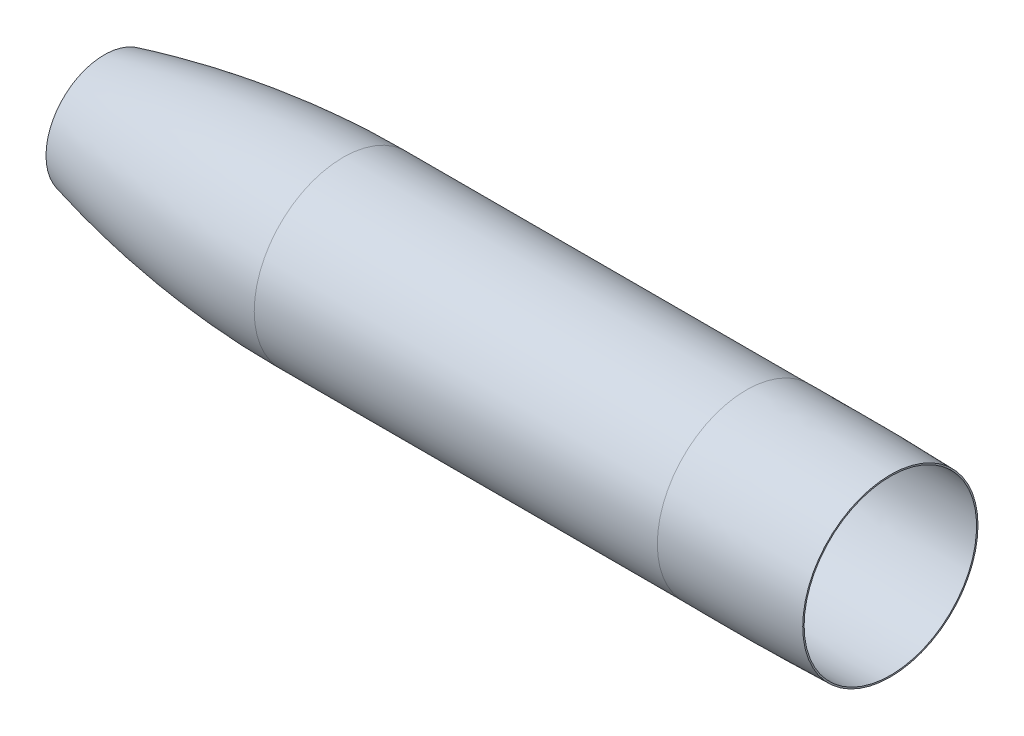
ISO-10303-21;
HEADER;
FILE_DESCRIPTION(('STEP AP214'),'2;1');
FILE_NAME('part.step','',(''),(''),'','','');
FILE_SCHEMA(('AUTOMOTIVE_DESIGN { 1 0 10303 214 1 1 1 1 }'));
ENDSEC;
DATA;
#1=APPLICATION_CONTEXT('core data for automotive mechanical design processes');
#2=APPLICATION_PROTOCOL_DEFINITION('international standard','automotive_design',2000,#1);
#3=PRODUCT_CONTEXT('',#1,'mechanical');
#4=PRODUCT('Part','Part','',(#3));
#5=PRODUCT_RELATED_PRODUCT_CATEGORY('part','',(#4));
#6=PRODUCT_DEFINITION_FORMATION('','',#4);
#7=PRODUCT_DEFINITION_CONTEXT('part definition',#1,'design');
#8=PRODUCT_DEFINITION('design','',#6,#7);
#9=PRODUCT_DEFINITION_SHAPE('','',#8);
#10=(LENGTH_UNIT() NAMED_UNIT(*) SI_UNIT(.MILLI.,.METRE.));
#11=(NAMED_UNIT(*) PLANE_ANGLE_UNIT() SI_UNIT($,.RADIAN.));
#12=(NAMED_UNIT(*) SI_UNIT($,.STERADIAN.) SOLID_ANGLE_UNIT());
#13=UNCERTAINTY_MEASURE_WITH_UNIT(LENGTH_MEASURE(1.E-05),#10,'distance_accuracy_value','');
#14=(GEOMETRIC_REPRESENTATION_CONTEXT(3) GLOBAL_UNCERTAINTY_ASSIGNED_CONTEXT((#13)) GLOBAL_UNIT_ASSIGNED_CONTEXT((#10,
#11,#12)) REPRESENTATION_CONTEXT('',''));
#15=CARTESIAN_POINT('',(0.,0.,0.));
#16=DIRECTION('',(0.,0.,1.));
#17=DIRECTION('',(1.,0.,0.));
#18=AXIS2_PLACEMENT_3D('',#15,#16,#17);
#19=CARTESIAN_POINT('',(1850.39,405.13,0.));
#20=CARTESIAN_POINT('',(1209.47050744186,405.13,0.));
#21=CARTESIAN_POINT('',(585.273449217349,258.505072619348,0.));
#22=CARTESIAN_POINT('',(0.,0.,0.));
#23=B_SPLINE_CURVE_WITH_KNOTS('',3,(#19,#20,#21,#22),.UNSPECIFIED.,.F.,.F.,(4,4),(0.,1.),.UNSPECIFIED.);
#24=CARTESIAN_POINT('',(0.,0.,0.));
#25=DIRECTION('',(-1.,0.,0.));
#26=AXIS1_PLACEMENT('',#24,#25);
#27=SURFACE_OF_REVOLUTION('',#23,#26);
#28=CARTESIAN_POINT('',(761.999999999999,0.,0.));
#29=DIRECTION('',(-1.,0.,0.));
#30=DIRECTION('',(0.,0.,1.));
#31=AXIS2_PLACEMENT_3D('',#28,#29,#30);
#32=CIRCLE('',#31,265.376558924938);
#33=CARTESIAN_POINT('',(761.999999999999,0.,265.376558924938));
#34=VERTEX_POINT('',#33);
#35=EDGE_CURVE('E66',#34,#34,#32,.T.);
#36=ORIENTED_EDGE('',*,*,#35,.F.);
#37=EDGE_LOOP('',(#36));
#38=FACE_BOUND('',#37,.T.);
#39=CARTESIAN_POINT('',(1850.39,0.,0.));
#40=DIRECTION('',(-1.,0.,0.));
#41=DIRECTION('',(0.,0.,1.));
#42=AXIS2_PLACEMENT_3D('',#39,#40,#41);
#43=CIRCLE('',#42,405.13);
#44=CARTESIAN_POINT('',(1850.39,0.,405.13));
#45=VERTEX_POINT('',#44);
#46=EDGE_CURVE('E10',#45,#45,#43,.T.);
#47=ORIENTED_EDGE('',*,*,#46,.T.);
#48=EDGE_LOOP('',(#47));
#49=FACE_BOUND('',#48,.T.);
#50=ADVANCED_FACE('F31',(#38,#49),#27,.T.);
#51=CARTESIAN_POINT('',(0.,0.,0.));
#52=DIRECTION('',(-1.,0.,0.));
#53=DIRECTION('',(0.,0.,1.));
#54=AXIS2_PLACEMENT_3D('',#51,#52,#53);
#55=CYLINDRICAL_SURFACE('',#54,405.13);
#56=ORIENTED_EDGE('',*,*,#46,.F.);
#57=EDGE_LOOP('',(#56));
#58=FACE_BOUND('',#57,.T.);
#59=CARTESIAN_POINT('',(3686.81,0.,0.));
#60=DIRECTION('',(-1.,0.,0.));
#61=DIRECTION('',(0.,0.,1.));
#62=AXIS2_PLACEMENT_3D('',#59,#60,#61);
#63=CIRCLE('',#62,405.13);
#64=CARTESIAN_POINT('',(3686.81,0.,405.13));
#65=VERTEX_POINT('',#64);
#66=EDGE_CURVE('E38',#65,#65,#63,.T.);
#67=ORIENTED_EDGE('',*,*,#66,.T.);
#68=EDGE_LOOP('',(#67));
#69=FACE_BOUND('',#68,.T.);
#70=ADVANCED_FACE('F85',(#58,#69),#55,.T.);
#71=CARTESIAN_POINT('',(5045.37811204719,301.379838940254,0.));
#72=CARTESIAN_POINT('',(4898.10578917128,353.95226404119,0.));
#73=CARTESIAN_POINT('',(4444.95601981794,411.256271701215,0.));
#74=CARTESIAN_POINT('',(3979.80182322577,405.13,0.));
#75=CARTESIAN_POINT('',(3686.81,405.13,0.));
#76=B_SPLINE_CURVE_WITH_KNOTS('',3,(#71,#72,#73,#74,#75),.UNSPECIFIED.,.F.,.F.,(4,1,4),(0.,
0.339771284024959,1.),.UNSPECIFIED.);
#77=CARTESIAN_POINT('',(0.,0.,0.));
#78=DIRECTION('',(-1.,0.,0.));
#79=AXIS1_PLACEMENT('',#77,#78);
#80=SURFACE_OF_REVOLUTION('',#76,#79);
#81=ORIENTED_EDGE('',*,*,#66,.F.);
#82=EDGE_LOOP('',(#81));
#83=FACE_BOUND('',#82,.T.);
#84=CARTESIAN_POINT('',(4343.39999997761,0.,0.));
#85=DIRECTION('',(-1.,0.,0.));
#86=DIRECTION('',(0.,0.,1.));
#87=AXIS2_PLACEMENT_3D('',#84,#85,#86);
#88=CIRCLE('',#87,399.27049456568);
#89=CARTESIAN_POINT('',(4343.39999997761,0.,399.27049456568));
#90=VERTEX_POINT('',#89);
#91=EDGE_CURVE('E42',#90,#90,#88,.T.);
#92=ORIENTED_EDGE('',*,*,#91,.T.);
#93=EDGE_LOOP('',(#92));
#94=FACE_BOUND('',#93,.T.);
#95=ADVANCED_FACE('F81',(#83,#94),#80,.T.);
#96=CARTESIAN_POINT('',(4343.3999999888,399.27049456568,0.));
#97=DIRECTION('',(-1.,0.,0.));
#98=DIRECTION('',(0.,0.,1.));
#99=AXIS2_PLACEMENT_3D('',#96,#97,#98);
#100=PLANE('',#99);
#101=ORIENTED_EDGE('',*,*,#91,.F.);
#102=EDGE_LOOP('',(#101));
#103=FACE_BOUND('',#102,.T.);
#104=CARTESIAN_POINT('',(4343.39999999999,0.,0.));
#105=DIRECTION('',(-1.,0.,0.));
#106=DIRECTION('',(0.,0.,1.));
#107=AXIS2_PLACEMENT_3D('',#104,#105,#106);
#108=CIRCLE('',#107,392.916330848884);
#109=CARTESIAN_POINT('',(4343.39999999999,0.,392.916330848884));
#110=VERTEX_POINT('',#109);
#111=EDGE_CURVE('E46',#110,#110,#108,.T.);
#112=ORIENTED_EDGE('',*,*,#111,.T.);
#113=EDGE_LOOP('',(#112));
#114=FACE_BOUND('',#113,.T.);
#115=ADVANCED_FACE('F84',(#103,#114),#100,.F.);
#116=CARTESIAN_POINT('',(4343.17025855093,0.,0.));
#117=DIRECTION('',(-1.,0.,0.));
#118=DIRECTION('',(0.,0.,1.));
#119=AXIS2_PLACEMENT_3D('',#116,#117,#118);
#120=CONICAL_SURFACE('',#119,392.924651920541,0.0362034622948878);
#121=ORIENTED_EDGE('',*,*,#111,.F.);
#122=EDGE_LOOP('',(#121));
#123=FACE_BOUND('',#122,.T.);
#124=CARTESIAN_POINT('',(4343.17025855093,0.,0.));
#125=DIRECTION('',(-1.,0.,0.));
#126=DIRECTION('',(0.,0.,1.));
#127=AXIS2_PLACEMENT_3D('',#124,#125,#126);
#128=CIRCLE('',#127,392.924651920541);
#129=CARTESIAN_POINT('',(4343.17025855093,0.,392.924651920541));
#130=VERTEX_POINT('',#129);
#131=EDGE_CURVE('E51',#130,#130,#128,.T.);
#132=ORIENTED_EDGE('',*,*,#131,.T.);
#133=EDGE_LOOP('',(#132));
#134=FACE_BOUND('',#133,.T.);
#135=ADVANCED_FACE('F132',(#123,#134),#120,.F.);
#136=CARTESIAN_POINT('',(3686.81,398.78,0.));
#137=CARTESIAN_POINT('',(3693.50132097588,398.78,0.));
#138=CARTESIAN_POINT('',(3706.87373723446,398.784209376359,0.));
#139=CARTESIAN_POINT('',(3733.70036827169,398.806455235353,0.));
#140=CARTESIAN_POINT('',(3767.32625477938,398.854544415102,0.));
#141=CARTESIAN_POINT('',(3807.83248288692,398.926644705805,0.));
#142=CARTESIAN_POINT('',(3862.0266163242,399.01789912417,0.));
#143=CARTESIAN_POINT('',(3930.09328055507,399.077687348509,0.));
#144=CARTESIAN_POINT('',(4039.57185631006,398.865107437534,0.));
#145=CARTESIAN_POINT('',(4149.7362795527,397.901407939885,0.));
#146=CARTESIAN_POINT('',(4260.22263334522,395.610131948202,0.));
#147=CARTESIAN_POINT('',(4315.53156476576,393.925268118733,0.));
#148=CARTESIAN_POINT('',(4343.17025855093,392.924651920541,0.));
#149=B_SPLINE_CURVE_WITH_KNOTS('',3,(#136,#137,#138,#139,#140,#141,#142,#143,#144,#145,#146,
#147,#148),.UNSPECIFIED.,.F.,.F.,(4,1,1,1,1,1,1,1,1,1,4),(0.51810759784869,0.533166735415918,
0.548225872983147,0.578344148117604,0.608462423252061,0.638580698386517,0.698817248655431,
0.759053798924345,0.879526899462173,0.939763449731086,1.),.UNSPECIFIED.);
#150=CARTESIAN_POINT('',(0.,0.,0.));
#151=DIRECTION('',(-1.,0.,0.));
#152=AXIS1_PLACEMENT('',#150,#151);
#153=SURFACE_OF_REVOLUTION('',#149,#152);
#154=ORIENTED_EDGE('',*,*,#131,.F.);
#155=EDGE_LOOP('',(#154));
#156=FACE_BOUND('',#155,.T.);
#157=CARTESIAN_POINT('',(3686.81,0.,0.));
#158=DIRECTION('',(-1.,0.,0.));
#159=DIRECTION('',(0.,0.,1.));
#160=AXIS2_PLACEMENT_3D('',#157,#158,#159);
#161=CIRCLE('',#160,398.78);
#162=CARTESIAN_POINT('',(3686.81,0.,398.78));
#163=VERTEX_POINT('',#162);
#164=EDGE_CURVE('E54',#163,#163,#161,.T.);
#165=ORIENTED_EDGE('',*,*,#164,.T.);
#166=EDGE_LOOP('',(#165));
#167=FACE_BOUND('',#166,.T.);
#168=ADVANCED_FACE('F129',(#156,#167),#153,.T.);
#169=CARTESIAN_POINT('',(0.,0.,0.));
#170=DIRECTION('',(-1.,0.,0.));
#171=DIRECTION('',(0.,0.,1.));
#172=AXIS2_PLACEMENT_3D('',#169,#170,#171);
#173=CYLINDRICAL_SURFACE('',#172,398.78);
#174=ORIENTED_EDGE('',*,*,#164,.F.);
#175=EDGE_LOOP('',(#174));
#176=FACE_BOUND('',#175,.T.);
#177=CARTESIAN_POINT('',(1850.39,0.,0.));
#178=DIRECTION('',(-1.,0.,0.));
#179=DIRECTION('',(0.,0.,1.));
#180=AXIS2_PLACEMENT_3D('',#177,#178,#179);
#181=CIRCLE('',#180,398.78);
#182=CARTESIAN_POINT('',(1850.39,0.,398.78));
#183=VERTEX_POINT('',#182);
#184=EDGE_CURVE('E57',#183,#183,#181,.T.);
#185=ORIENTED_EDGE('',*,*,#184,.T.);
#186=EDGE_LOOP('',(#185));
#187=FACE_BOUND('',#186,.T.);
#188=ADVANCED_FACE('F113',(#176,#187),#173,.F.);
#189=CARTESIAN_POINT('',(763.578421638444,259.225860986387,0.));
#190=CARTESIAN_POINT('',(807.802579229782,270.574876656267,0.));
#191=CARTESIAN_POINT('',(896.603973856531,291.969847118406,0.));
#192=CARTESIAN_POINT('',(1030.63533364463,320.029014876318,0.));
#193=CARTESIAN_POINT('',(1165.49446180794,343.989409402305,0.));
#194=CARTESIAN_POINT('',(1301.11867971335,363.769834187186,0.));
#195=CARTESIAN_POINT('',(1437.46181965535,379.293292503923,0.));
#196=CARTESIAN_POINT('',(1551.63790533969,388.616918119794,0.));
#197=CARTESIAN_POINT('',(1643.28854122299,393.86933797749,0.));
#198=CARTESIAN_POINT('',(1712.1743025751,396.695663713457,0.));
#199=CARTESIAN_POINT('',(1769.70009699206,398.115325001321,0.));
#200=CARTESIAN_POINT('',(1815.78348629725,398.684814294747,0.));
#201=CARTESIAN_POINT('',(1838.85705356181,398.78,0.));
#202=CARTESIAN_POINT('',(1850.39,398.78,0.));
#203=B_SPLINE_CURVE_WITH_KNOTS('',3,(#189,#190,#191,#192,#193,#194,#195,#196,#197,#198,#199,
#200,#201,#202),.UNSPECIFIED.,.F.,.F.,(4,1,1,1,1,1,1,1,1,1,1,4),(0.,0.0721199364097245,
0.144239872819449,0.216359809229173,0.288479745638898,0.360599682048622,0.432719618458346,
0.468779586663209,0.504839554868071,0.540899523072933,0.558929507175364,0.576959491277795),.UNSPECIFIED.);
#204=CARTESIAN_POINT('',(0.,0.,0.));
#205=DIRECTION('',(-1.,0.,0.));
#206=AXIS1_PLACEMENT('',#204,#205);
#207=SURFACE_OF_REVOLUTION('',#203,#206);
#208=ORIENTED_EDGE('',*,*,#184,.F.);
#209=EDGE_LOOP('',(#208));
#210=FACE_BOUND('',#209,.T.);
#211=CARTESIAN_POINT('',(763.578421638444,0.,0.));
#212=DIRECTION('',(-1.,0.,0.));
#213=DIRECTION('',(0.,0.,1.));
#214=AXIS2_PLACEMENT_3D('',#211,#212,#213);
#215=CIRCLE('',#214,259.225860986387);
#216=CARTESIAN_POINT('',(763.578421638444,0.,259.225860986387));
#217=VERTEX_POINT('',#216);
#218=EDGE_CURVE('E60',#217,#217,#215,.T.);
#219=ORIENTED_EDGE('',*,*,#218,.T.);
#220=EDGE_LOOP('',(#219));
#221=FACE_BOUND('',#220,.T.);
#222=ADVANCED_FACE('F106',(#210,#221),#207,.T.);
#223=CARTESIAN_POINT('',(761.999999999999,0.,0.));
#224=DIRECTION('',(1.,0.,0.));
#225=DIRECTION('',(0.,0.,-1.));
#226=AXIS2_PLACEMENT_3D('',#223,#224,#225);
#227=CONICAL_SURFACE('',#226,258.820798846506,0.251203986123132);
#228=ORIENTED_EDGE('',*,*,#218,.F.);
#229=EDGE_LOOP('',(#228));
#230=FACE_BOUND('',#229,.T.);
#231=CARTESIAN_POINT('',(761.999999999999,0.,0.));
#232=DIRECTION('',(-1.,0.,0.));
#233=DIRECTION('',(0.,0.,1.));
#234=AXIS2_PLACEMENT_3D('',#231,#232,#233);
#235=CIRCLE('',#234,258.820798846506);
#236=CARTESIAN_POINT('',(761.999999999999,0.,258.820798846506));
#237=VERTEX_POINT('',#236);
#238=EDGE_CURVE('E63',#237,#237,#235,.T.);
#239=ORIENTED_EDGE('',*,*,#238,.T.);
#240=EDGE_LOOP('',(#239));
#241=FACE_BOUND('',#240,.T.);
#242=ADVANCED_FACE('F100',(#230,#241),#227,.F.);
#243=CARTESIAN_POINT('',(761.999999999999,265.376558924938,0.));
#244=DIRECTION('',(1.,0.,0.));
#245=DIRECTION('',(0.,0.,-1.));
#246=AXIS2_PLACEMENT_3D('',#243,#244,#245);
#247=PLANE('',#246);
#248=ORIENTED_EDGE('',*,*,#238,.F.);
#249=EDGE_LOOP('',(#248));
#250=FACE_BOUND('',#249,.T.);
#251=ORIENTED_EDGE('',*,*,#35,.T.);
#252=EDGE_LOOP('',(#251));
#253=FACE_BOUND('',#252,.T.);
#254=ADVANCED_FACE('F98',(#250,#253),#247,.F.);
#255=CLOSED_SHELL('',(#50,#70,#95,#115,#135,#168,#188,#222,#242,#254));
#256=MANIFOLD_SOLID_BREP('B2',#255);
#257=ADVANCED_BREP_SHAPE_REPRESENTATION('',(#18,#256),#14);
#258=SHAPE_DEFINITION_REPRESENTATION(#9,#257);
ENDSEC;
END-ISO-10303-21;
